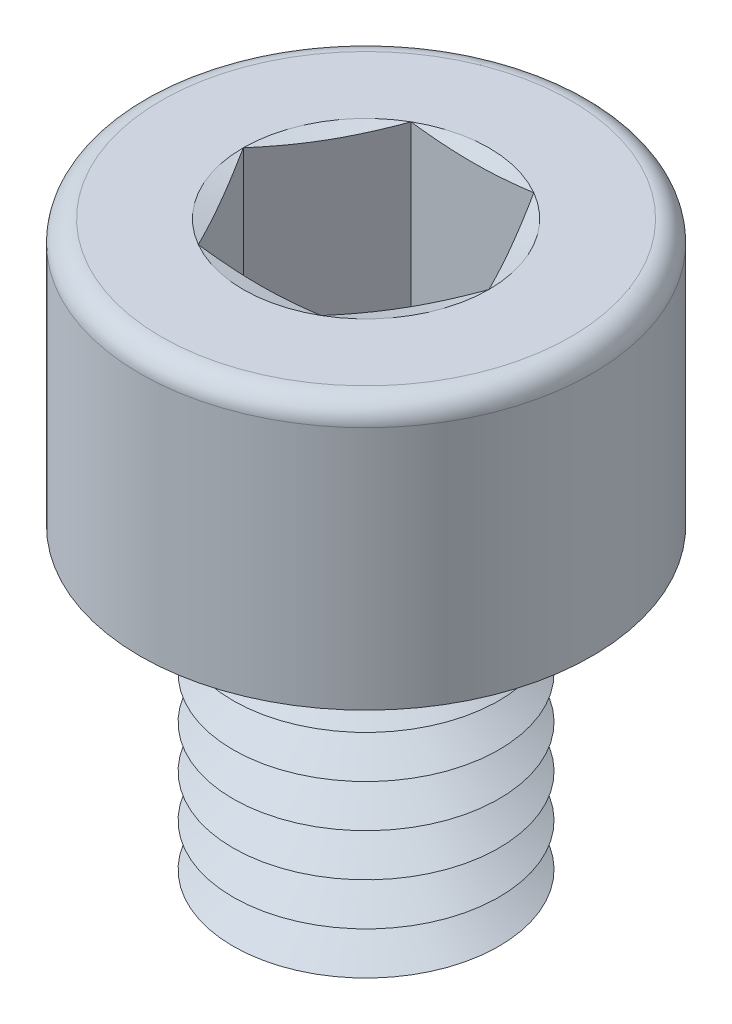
ISO-10303-21;
HEADER;
FILE_DESCRIPTION(('STEP AP214'),'2;1');
FILE_NAME('part.step','',(''),(''),'','','');
FILE_SCHEMA(('AUTOMOTIVE_DESIGN { 1 0 10303 214 1 1 1 1 }'));
ENDSEC;
DATA;
#1=APPLICATION_CONTEXT('core data for automotive mechanical design processes');
#2=APPLICATION_PROTOCOL_DEFINITION('international standard','automotive_design',2000,#1);
#3=PRODUCT_CONTEXT('',#1,'mechanical');
#4=PRODUCT('Part','Part','',(#3));
#5=PRODUCT_RELATED_PRODUCT_CATEGORY('part','',(#4));
#6=PRODUCT_DEFINITION_FORMATION('','',#4);
#7=PRODUCT_DEFINITION_CONTEXT('part definition',#1,'design');
#8=PRODUCT_DEFINITION('design','',#6,#7);
#9=PRODUCT_DEFINITION_SHAPE('','',#8);
#10=(LENGTH_UNIT() NAMED_UNIT(*) SI_UNIT(.MILLI.,.METRE.));
#11=(NAMED_UNIT(*) PLANE_ANGLE_UNIT() SI_UNIT($,.RADIAN.));
#12=(NAMED_UNIT(*) SI_UNIT($,.STERADIAN.) SOLID_ANGLE_UNIT());
#13=UNCERTAINTY_MEASURE_WITH_UNIT(LENGTH_MEASURE(1.E-05),#10,'distance_accuracy_value','');
#14=(GEOMETRIC_REPRESENTATION_CONTEXT(3) GLOBAL_UNCERTAINTY_ASSIGNED_CONTEXT((#13)) GLOBAL_UNIT_ASSIGNED_CONTEXT((#10,
#11,#12)) REPRESENTATION_CONTEXT('',''));
#15=CARTESIAN_POINT('',(0.,0.,0.));
#16=DIRECTION('',(0.,0.,1.));
#17=DIRECTION('',(1.,0.,0.));
#18=AXIS2_PLACEMENT_3D('',#15,#16,#17);
#19=CARTESIAN_POINT('',(0.,3.2,0.));
#20=DIRECTION('',(0.,1.,0.));
#21=DIRECTION('',(0.,0.,1.));
#22=AXIS2_PLACEMENT_3D('',#19,#20,#21);
#23=CONICAL_SURFACE('',#22,1.80717967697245,1.0471975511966);
#24=CARTESIAN_POINT('',(0.,3.6,0.));
#25=DIRECTION('',(0.,1.,0.));
#26=DIRECTION('',(0.,0.,1.));
#27=AXIS2_PLACEMENT_3D('',#24,#25,#26);
#28=CIRCLE('',#27,2.5);
#29=CARTESIAN_POINT('',(0.,3.6,2.5));
#30=VERTEX_POINT('',#29);
#31=EDGE_CURVE('E369',#30,#30,#28,.T.);
#32=ORIENTED_EDGE('',*,*,#31,.F.);
#33=EDGE_LOOP('',(#32));
#34=FACE_BOUND('',#33,.T.);
#35=CARTESIAN_POINT('',(0.,3.2,0.));
#36=DIRECTION('',(0.,1.,0.));
#37=DIRECTION('',(0.,0.,1.));
#38=AXIS2_PLACEMENT_3D('',#35,#36,#37);
#39=CIRCLE('',#38,1.80717967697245);
#40=CARTESIAN_POINT('',(0.,3.2,1.80717967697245));
#41=VERTEX_POINT('',#40);
#42=EDGE_CURVE('E373',#41,#41,#39,.T.);
#43=ORIENTED_EDGE('',*,*,#42,.T.);
#44=EDGE_LOOP('',(#43));
#45=FACE_BOUND('',#44,.T.);
#46=ADVANCED_FACE('F41',(#34,#45),#23,.T.);
#47=CARTESIAN_POINT('',(0.,2.8,0.));
#48=DIRECTION('',(0.,-1.,0.));
#49=DIRECTION('',(0.,0.,-1.));
#50=AXIS2_PLACEMENT_3D('',#47,#48,#49);
#51=CONICAL_SURFACE('',#50,2.5,1.0471975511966);
#52=ORIENTED_EDGE('',*,*,#42,.F.);
#53=EDGE_LOOP('',(#52));
#54=FACE_BOUND('',#53,.T.);
#55=CARTESIAN_POINT('',(0.,2.8,0.));
#56=DIRECTION('',(0.,1.,0.));
#57=DIRECTION('',(0.,0.,1.));
#58=AXIS2_PLACEMENT_3D('',#55,#56,#57);
#59=CIRCLE('',#58,2.5);
#60=CARTESIAN_POINT('',(0.,2.8,2.5));
#61=VERTEX_POINT('',#60);
#62=EDGE_CURVE('E377',#61,#61,#59,.T.);
#63=ORIENTED_EDGE('',*,*,#62,.T.);
#64=EDGE_LOOP('',(#63));
#65=FACE_BOUND('',#64,.T.);
#66=ADVANCED_FACE('F249',(#54,#65),#51,.T.);
#67=CARTESIAN_POINT('',(0.,0.,0.));
#68=DIRECTION('',(0.,1.,0.));
#69=DIRECTION('',(0.,0.,1.));
#70=AXIS2_PLACEMENT_3D('',#67,#68,#69);
#71=PLANE('',#70);
#72=CARTESIAN_POINT('',(0.,0.,0.));
#73=DIRECTION('',(0.,1.,0.));
#74=DIRECTION('',(0.,0.,1.));
#75=AXIS2_PLACEMENT_3D('',#72,#73,#74);
#76=CIRCLE('',#75,1.80717967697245);
#77=CARTESIAN_POINT('',(0.,0.,1.80717967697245));
#78=VERTEX_POINT('',#77);
#79=EDGE_CURVE('E404',#78,#78,#76,.T.);
#80=ORIENTED_EDGE('',*,*,#79,.F.);
#81=EDGE_LOOP('',(#80));
#82=FACE_BOUND('',#81,.T.);
#83=ADVANCED_FACE('F246',(#82),#71,.F.);
#84=CARTESIAN_POINT('',(0.,0.,0.));
#85=DIRECTION('',(0.,1.,0.));
#86=DIRECTION('',(0.,0.,1.));
#87=AXIS2_PLACEMENT_3D('',#84,#85,#86);
#88=CONICAL_SURFACE('',#87,1.80717967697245,1.0471975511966);
#89=CARTESIAN_POINT('',(0.,0.4,0.));
#90=DIRECTION('',(0.,1.,0.));
#91=DIRECTION('',(0.,0.,1.));
#92=AXIS2_PLACEMENT_3D('',#89,#90,#91);
#93=CIRCLE('',#92,2.5);
#94=CARTESIAN_POINT('',(0.,0.4,2.5));
#95=VERTEX_POINT('',#94);
#96=EDGE_CURVE('E400',#95,#95,#93,.T.);
#97=ORIENTED_EDGE('',*,*,#96,.F.);
#98=EDGE_LOOP('',(#97));
#99=FACE_BOUND('',#98,.T.);
#100=ORIENTED_EDGE('',*,*,#79,.T.);
#101=EDGE_LOOP('',(#100));
#102=FACE_BOUND('',#101,.T.);
#103=ADVANCED_FACE('F248',(#99,#102),#88,.T.);
#104=CARTESIAN_POINT('',(0.,0.4,0.));
#105=DIRECTION('',(0.,-1.,0.));
#106=DIRECTION('',(0.,0.,-1.));
#107=AXIS2_PLACEMENT_3D('',#104,#105,#106);
#108=CONICAL_SURFACE('',#107,2.5,1.0471975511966);
#109=CARTESIAN_POINT('',(0.,0.8,0.));
#110=DIRECTION('',(0.,1.,0.));
#111=DIRECTION('',(0.,0.,1.));
#112=AXIS2_PLACEMENT_3D('',#109,#110,#111);
#113=CIRCLE('',#112,1.80717967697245);
#114=CARTESIAN_POINT('',(0.,0.8,1.80717967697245));
#115=VERTEX_POINT('',#114);
#116=EDGE_CURVE('E396',#115,#115,#113,.T.);
#117=ORIENTED_EDGE('',*,*,#116,.F.);
#118=EDGE_LOOP('',(#117));
#119=FACE_BOUND('',#118,.T.);
#120=ORIENTED_EDGE('',*,*,#96,.T.);
#121=EDGE_LOOP('',(#120));
#122=FACE_BOUND('',#121,.T.);
#123=ADVANCED_FACE('F255',(#119,#122),#108,.T.);
#124=CARTESIAN_POINT('',(0.,0.8,0.));
#125=DIRECTION('',(0.,1.,0.));
#126=DIRECTION('',(0.,0.,1.));
#127=AXIS2_PLACEMENT_3D('',#124,#125,#126);
#128=CONICAL_SURFACE('',#127,1.80717967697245,1.0471975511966);
#129=CARTESIAN_POINT('',(0.,1.2,0.));
#130=DIRECTION('',(0.,1.,0.));
#131=DIRECTION('',(0.,0.,1.));
#132=AXIS2_PLACEMENT_3D('',#129,#130,#131);
#133=CIRCLE('',#132,2.5);
#134=CARTESIAN_POINT('',(0.,1.2,2.5));
#135=VERTEX_POINT('',#134);
#136=EDGE_CURVE('E393',#135,#135,#133,.T.);
#137=ORIENTED_EDGE('',*,*,#136,.F.);
#138=EDGE_LOOP('',(#137));
#139=FACE_BOUND('',#138,.T.);
#140=ORIENTED_EDGE('',*,*,#116,.T.);
#141=EDGE_LOOP('',(#140));
#142=FACE_BOUND('',#141,.T.);
#143=ADVANCED_FACE('F283',(#139,#142),#128,.T.);
#144=CARTESIAN_POINT('',(0.,1.2,0.));
#145=DIRECTION('',(0.,-1.,0.));
#146=DIRECTION('',(0.,0.,-1.));
#147=AXIS2_PLACEMENT_3D('',#144,#145,#146);
#148=CONICAL_SURFACE('',#147,2.5,1.0471975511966);
#149=CARTESIAN_POINT('',(0.,1.6,0.));
#150=DIRECTION('',(0.,1.,0.));
#151=DIRECTION('',(0.,0.,1.));
#152=AXIS2_PLACEMENT_3D('',#149,#150,#151);
#153=CIRCLE('',#152,1.80717967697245);
#154=CARTESIAN_POINT('',(0.,1.6,1.80717967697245));
#155=VERTEX_POINT('',#154);
#156=EDGE_CURVE('E389',#155,#155,#153,.T.);
#157=ORIENTED_EDGE('',*,*,#156,.F.);
#158=EDGE_LOOP('',(#157));
#159=FACE_BOUND('',#158,.T.);
#160=ORIENTED_EDGE('',*,*,#136,.T.);
#161=EDGE_LOOP('',(#160));
#162=FACE_BOUND('',#161,.T.);
#163=ADVANCED_FACE('F280',(#159,#162),#148,.T.);
#164=CARTESIAN_POINT('',(0.,1.6,0.));
#165=DIRECTION('',(0.,1.,0.));
#166=DIRECTION('',(0.,0.,1.));
#167=AXIS2_PLACEMENT_3D('',#164,#165,#166);
#168=CONICAL_SURFACE('',#167,1.80717967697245,1.0471975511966);
#169=CARTESIAN_POINT('',(0.,2.,0.));
#170=DIRECTION('',(0.,1.,0.));
#171=DIRECTION('',(0.,0.,1.));
#172=AXIS2_PLACEMENT_3D('',#169,#170,#171);
#173=CIRCLE('',#172,2.5);
#174=CARTESIAN_POINT('',(0.,2.,2.5));
#175=VERTEX_POINT('',#174);
#176=EDGE_CURVE('E385',#175,#175,#173,.T.);
#177=ORIENTED_EDGE('',*,*,#176,.F.);
#178=EDGE_LOOP('',(#177));
#179=FACE_BOUND('',#178,.T.);
#180=ORIENTED_EDGE('',*,*,#156,.T.);
#181=EDGE_LOOP('',(#180));
#182=FACE_BOUND('',#181,.T.);
#183=ADVANCED_FACE('F274',(#179,#182),#168,.T.);
#184=CARTESIAN_POINT('',(0.,2.,0.));
#185=DIRECTION('',(0.,-1.,0.));
#186=DIRECTION('',(0.,0.,-1.));
#187=AXIS2_PLACEMENT_3D('',#184,#185,#186);
#188=CONICAL_SURFACE('',#187,2.5,1.0471975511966);
#189=CARTESIAN_POINT('',(0.,2.4,0.));
#190=DIRECTION('',(0.,1.,0.));
#191=DIRECTION('',(0.,0.,1.));
#192=AXIS2_PLACEMENT_3D('',#189,#190,#191);
#193=CIRCLE('',#192,1.80717967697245);
#194=CARTESIAN_POINT('',(0.,2.4,1.80717967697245));
#195=VERTEX_POINT('',#194);
#196=EDGE_CURVE('E381',#195,#195,#193,.T.);
#197=ORIENTED_EDGE('',*,*,#196,.F.);
#198=EDGE_LOOP('',(#197));
#199=FACE_BOUND('',#198,.T.);
#200=ORIENTED_EDGE('',*,*,#176,.T.);
#201=EDGE_LOOP('',(#200));
#202=FACE_BOUND('',#201,.T.);
#203=ADVANCED_FACE('F270',(#199,#202),#188,.T.);
#204=CARTESIAN_POINT('',(0.,2.4,0.));
#205=DIRECTION('',(0.,1.,0.));
#206=DIRECTION('',(0.,0.,1.));
#207=AXIS2_PLACEMENT_3D('',#204,#205,#206);
#208=CONICAL_SURFACE('',#207,1.80717967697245,1.0471975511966);
#209=ORIENTED_EDGE('',*,*,#62,.F.);
#210=EDGE_LOOP('',(#209));
#211=FACE_BOUND('',#210,.T.);
#212=ORIENTED_EDGE('',*,*,#196,.T.);
#213=EDGE_LOOP('',(#212));
#214=FACE_BOUND('',#213,.T.);
#215=ADVANCED_FACE('F273',(#211,#214),#208,.T.);
#216=CARTESIAN_POINT('',(0.,4.,0.));
#217=DIRECTION('',(0.,1.,0.));
#218=DIRECTION('',(0.,0.,1.));
#219=AXIS2_PLACEMENT_3D('',#216,#217,#218);
#220=CONICAL_SURFACE('',#219,1.80717967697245,1.0471975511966);
#221=CARTESIAN_POINT('',(0.,4.4,0.));
#222=DIRECTION('',(0.,1.,0.));
#223=DIRECTION('',(0.,0.,1.));
#224=AXIS2_PLACEMENT_3D('',#221,#222,#223);
#225=CIRCLE('',#224,2.5);
#226=CARTESIAN_POINT('',(0.,4.4,2.5));
#227=VERTEX_POINT('',#226);
#228=EDGE_CURVE('E361',#227,#227,#225,.T.);
#229=ORIENTED_EDGE('',*,*,#228,.F.);
#230=EDGE_LOOP('',(#229));
#231=FACE_BOUND('',#230,.T.);
#232=CARTESIAN_POINT('',(0.,4.,0.));
#233=DIRECTION('',(0.,1.,0.));
#234=DIRECTION('',(0.,0.,1.));
#235=AXIS2_PLACEMENT_3D('',#232,#233,#234);
#236=CIRCLE('',#235,1.80717967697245);
#237=CARTESIAN_POINT('',(0.,4.,1.80717967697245));
#238=VERTEX_POINT('',#237);
#239=EDGE_CURVE('E365',#238,#238,#236,.T.);
#240=ORIENTED_EDGE('',*,*,#239,.T.);
#241=EDGE_LOOP('',(#240));
#242=FACE_BOUND('',#241,.T.);
#243=ADVANCED_FACE('F278',(#231,#242),#220,.T.);
#244=CARTESIAN_POINT('',(0.,3.6,0.));
#245=DIRECTION('',(0.,-1.,0.));
#246=DIRECTION('',(0.,0.,-1.));
#247=AXIS2_PLACEMENT_3D('',#244,#245,#246);
#248=CONICAL_SURFACE('',#247,2.5,1.0471975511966);
#249=ORIENTED_EDGE('',*,*,#239,.F.);
#250=EDGE_LOOP('',(#249));
#251=FACE_BOUND('',#250,.T.);
#252=ORIENTED_EDGE('',*,*,#31,.T.);
#253=EDGE_LOOP('',(#252));
#254=FACE_BOUND('',#253,.T.);
#255=ADVANCED_FACE('F663',(#251,#254),#248,.T.);
#256=CARTESIAN_POINT('',(0.,4.8,0.));
#257=DIRECTION('',(0.,1.,0.));
#258=DIRECTION('',(0.,0.,1.));
#259=AXIS2_PLACEMENT_3D('',#256,#257,#258);
#260=CONICAL_SURFACE('',#259,1.80717967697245,1.0471975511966);
#261=CARTESIAN_POINT('',(0.,5.2,0.));
#262=DIRECTION('',(0.,1.,0.));
#263=DIRECTION('',(0.,0.,1.));
#264=AXIS2_PLACEMENT_3D('',#261,#262,#263);
#265=CIRCLE('',#264,2.5);
#266=CARTESIAN_POINT('',(0.,5.2,2.5));
#267=VERTEX_POINT('',#266);
#268=EDGE_CURVE('E345',#267,#267,#265,.T.);
#269=ORIENTED_EDGE('',*,*,#268,.F.);
#270=EDGE_LOOP('',(#269));
#271=FACE_BOUND('',#270,.T.);
#272=CARTESIAN_POINT('',(0.,4.8,0.));
#273=DIRECTION('',(0.,1.,0.));
#274=DIRECTION('',(0.,0.,1.));
#275=AXIS2_PLACEMENT_3D('',#272,#273,#274);
#276=CIRCLE('',#275,1.80717967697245);
#277=CARTESIAN_POINT('',(0.,4.8,1.80717967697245));
#278=VERTEX_POINT('',#277);
#279=EDGE_CURVE('E358',#278,#278,#276,.T.);
#280=ORIENTED_EDGE('',*,*,#279,.T.);
#281=EDGE_LOOP('',(#280));
#282=FACE_BOUND('',#281,.T.);
#283=ADVANCED_FACE('F672',(#271,#282),#260,.T.);
#284=CARTESIAN_POINT('',(0.,4.4,0.));
#285=DIRECTION('',(0.,-1.,0.));
#286=DIRECTION('',(0.,0.,-1.));
#287=AXIS2_PLACEMENT_3D('',#284,#285,#286);
#288=CONICAL_SURFACE('',#287,2.5,1.0471975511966);
#289=ORIENTED_EDGE('',*,*,#279,.F.);
#290=EDGE_LOOP('',(#289));
#291=FACE_BOUND('',#290,.T.);
#292=ORIENTED_EDGE('',*,*,#228,.T.);
#293=EDGE_LOOP('',(#292));
#294=FACE_BOUND('',#293,.T.);
#295=ADVANCED_FACE('F682',(#291,#294),#288,.T.);
#296=CARTESIAN_POINT('',(0.,5.6,0.));
#297=DIRECTION('',(0.,1.,0.));
#298=DIRECTION('',(0.,0.,1.));
#299=AXIS2_PLACEMENT_3D('',#296,#297,#298);
#300=CONICAL_SURFACE('',#299,1.80717967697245,1.0471975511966);
#301=CARTESIAN_POINT('',(0.,6.,0.));
#302=DIRECTION('',(0.,1.,0.));
#303=DIRECTION('',(0.,0.,1.));
#304=AXIS2_PLACEMENT_3D('',#301,#302,#303);
#305=CIRCLE('',#304,2.5);
#306=CARTESIAN_POINT('',(0.,6.,2.5));
#307=VERTEX_POINT('',#306);
#308=EDGE_CURVE('E352',#307,#307,#305,.T.);
#309=ORIENTED_EDGE('',*,*,#308,.F.);
#310=EDGE_LOOP('',(#309));
#311=FACE_BOUND('',#310,.T.);
#312=CARTESIAN_POINT('',(0.,5.6,0.));
#313=DIRECTION('',(0.,1.,0.));
#314=DIRECTION('',(0.,0.,1.));
#315=AXIS2_PLACEMENT_3D('',#312,#313,#314);
#316=CIRCLE('',#315,1.80717967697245);
#317=CARTESIAN_POINT('',(0.,5.6,1.80717967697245));
#318=VERTEX_POINT('',#317);
#319=EDGE_CURVE('E341',#318,#318,#316,.T.);
#320=ORIENTED_EDGE('',*,*,#319,.T.);
#321=EDGE_LOOP('',(#320));
#322=FACE_BOUND('',#321,.T.);
#323=ADVANCED_FACE('F692',(#311,#322),#300,.T.);
#324=CARTESIAN_POINT('',(0.,5.2,0.));
#325=DIRECTION('',(0.,-1.,0.));
#326=DIRECTION('',(0.,0.,-1.));
#327=AXIS2_PLACEMENT_3D('',#324,#325,#326);
#328=CONICAL_SURFACE('',#327,2.5,1.0471975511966);
#329=ORIENTED_EDGE('',*,*,#319,.F.);
#330=EDGE_LOOP('',(#329));
#331=FACE_BOUND('',#330,.T.);
#332=ORIENTED_EDGE('',*,*,#268,.T.);
#333=EDGE_LOOP('',(#332));
#334=FACE_BOUND('',#333,.T.);
#335=ADVANCED_FACE('F195',(#331,#334),#328,.T.);
#336=CARTESIAN_POINT('',(0.,11.,0.));
#337=DIRECTION('',(0.,1.,0.));
#338=DIRECTION('',(0.,0.,1.));
#339=AXIS2_PLACEMENT_3D('',#336,#337,#338);
#340=PLANE('',#339);
#341=CARTESIAN_POINT('',(0.,11.,0.));
#342=DIRECTION('',(0.,1.,0.));
#343=DIRECTION('',(0.,0.,1.));
#344=AXIS2_PLACEMENT_3D('',#341,#342,#343);
#345=CIRCLE('',#344,2.3094010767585);
#346=CARTESIAN_POINT('',(1.15470053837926,11.,2.));
#347=VERTEX_POINT('',#346);
#348=CARTESIAN_POINT('',(2.3094010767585,11.,0.));
#349=VERTEX_POINT('',#348);
#350=EDGE_CURVE('E121',#347,#349,#345,.T.);
#351=ORIENTED_EDGE('',*,*,#350,.F.);
#352=CARTESIAN_POINT('',(0.,11.,0.));
#353=DIRECTION('',(0.,1.,0.));
#354=DIRECTION('',(0.,0.,1.));
#355=AXIS2_PLACEMENT_3D('',#352,#353,#354);
#356=CIRCLE('',#355,2.3094010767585);
#357=CARTESIAN_POINT('',(-1.15470053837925,11.,2.));
#358=VERTEX_POINT('',#357);
#359=EDGE_CURVE('E45',#358,#347,#356,.T.);
#360=ORIENTED_EDGE('',*,*,#359,.F.);
#361=CARTESIAN_POINT('',(-2.3094010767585,11.,0.));
#362=VERTEX_POINT('',#361);
#363=EDGE_CURVE('E138',#362,#358,#356,.T.);
#364=ORIENTED_EDGE('',*,*,#363,.F.);
#365=CARTESIAN_POINT('',(-1.15470053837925,11.,-2.));
#366=VERTEX_POINT('',#365);
#367=EDGE_CURVE('E477',#366,#362,#356,.T.);
#368=ORIENTED_EDGE('',*,*,#367,.F.);
#369=CARTESIAN_POINT('',(1.15470053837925,11.,-2.));
#370=VERTEX_POINT('',#369);
#371=EDGE_CURVE('E51',#370,#366,#356,.T.);
#372=ORIENTED_EDGE('',*,*,#371,.F.);
#373=EDGE_CURVE('E11',#349,#370,#356,.T.);
#374=ORIENTED_EDGE('',*,*,#373,.F.);
#375=EDGE_LOOP('',(#351,#360,#364,#368,#372,#374));
#376=FACE_BOUND('',#375,.T.);
#377=CARTESIAN_POINT('',(0.,11.,0.));
#378=DIRECTION('',(0.,1.,0.));
#379=DIRECTION('',(0.,0.,1.));
#380=AXIS2_PLACEMENT_3D('',#377,#378,#379);
#381=CIRCLE('',#380,3.85);
#382=CARTESIAN_POINT('',(0.,11.,3.85));
#383=VERTEX_POINT('',#382);
#384=EDGE_CURVE('E444',#383,#383,#381,.T.);
#385=ORIENTED_EDGE('',*,*,#384,.T.);
#386=EDGE_LOOP('',(#385));
#387=FACE_BOUND('',#386,.T.);
#388=ADVANCED_FACE('F140',(#376,#387),#340,.T.);
#389=CARTESIAN_POINT('',(0.,10.6,0.));
#390=DIRECTION('',(0.,1.,0.));
#391=DIRECTION('',(0.,0.,1.));
#392=AXIS2_PLACEMENT_3D('',#389,#390,#391);
#393=TOROIDAL_SURFACE('',#392,3.85,0.4);
#394=CARTESIAN_POINT('',(0.,10.6,0.));
#395=DIRECTION('',(0.,1.,0.));
#396=DIRECTION('',(0.,0.,1.));
#397=AXIS2_PLACEMENT_3D('',#394,#395,#396);
#398=CIRCLE('',#397,4.25);
#399=CARTESIAN_POINT('',(0.,10.6,4.25));
#400=VERTEX_POINT('',#399);
#401=EDGE_CURVE('E448',#400,#400,#398,.F.);
#402=ORIENTED_EDGE('',*,*,#401,.F.);
#403=EDGE_LOOP('',(#402));
#404=FACE_BOUND('',#403,.T.);
#405=ORIENTED_EDGE('',*,*,#384,.F.);
#406=EDGE_LOOP('',(#405));
#407=FACE_BOUND('',#406,.T.);
#408=ADVANCED_FACE('F43',(#404,#407),#393,.T.);
#409=CARTESIAN_POINT('',(0.,11.,0.));
#410=DIRECTION('',(0.,-1.,0.));
#411=DIRECTION('',(0.,0.,-1.));
#412=AXIS2_PLACEMENT_3D('',#409,#410,#411);
#413=CYLINDRICAL_SURFACE('',#412,4.25);
#414=ORIENTED_EDGE('',*,*,#401,.T.);
#415=EDGE_LOOP('',(#414));
#416=FACE_BOUND('',#415,.T.);
#417=CARTESIAN_POINT('',(0.,6.,0.));
#418=DIRECTION('',(0.,1.,0.));
#419=DIRECTION('',(0.,0.,1.));
#420=AXIS2_PLACEMENT_3D('',#417,#418,#419);
#421=CIRCLE('',#420,4.25);
#422=CARTESIAN_POINT('',(0.,6.,4.25));
#423=VERTEX_POINT('',#422);
#424=EDGE_CURVE('E435',#423,#423,#421,.T.);
#425=ORIENTED_EDGE('',*,*,#424,.T.);
#426=EDGE_LOOP('',(#425));
#427=FACE_BOUND('',#426,.T.);
#428=ADVANCED_FACE('F242',(#416,#427),#413,.T.);
#429=CARTESIAN_POINT('',(0.,6.,0.));
#430=DIRECTION('',(0.,1.,0.));
#431=DIRECTION('',(0.,0.,1.));
#432=AXIS2_PLACEMENT_3D('',#429,#430,#431);
#433=PLANE('',#432);
#434=ORIENTED_EDGE('',*,*,#424,.F.);
#435=EDGE_LOOP('',(#434));
#436=FACE_BOUND('',#435,.T.);
#437=ORIENTED_EDGE('',*,*,#308,.T.);
#438=EDGE_LOOP('',(#437));
#439=FACE_BOUND('',#438,.T.);
#440=ADVANCED_FACE('F239',(#436,#439),#433,.F.);
#441=CARTESIAN_POINT('',(0.,11.,0.));
#442=DIRECTION('',(0.,1.,0.));
#443=DIRECTION('',(0.,0.,1.));
#444=AXIS2_PLACEMENT_3D('',#441,#442,#443);
#445=CONICAL_SURFACE('',#444,2.3094010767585,1.30899693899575);
#446=ORIENTED_EDGE('',*,*,#359,.T.);
#447=CARTESIAN_POINT('',(-3.01440758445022,11.3505168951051,2.));
#448=CARTESIAN_POINT('',(-2.92409762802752,11.3303563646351,2.));
#449=CARTESIAN_POINT('',(-2.83373054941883,11.3104525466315,2.));
#450=CARTESIAN_POINT('',(-2.65285291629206,11.2712885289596,2.));
#451=CARTESIAN_POINT('',(-2.562342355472,11.2520283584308,2.));
#452=CARTESIAN_POINT('',(-2.29037985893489,11.1953730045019,2.));
#453=CARTESIAN_POINT('',(-2.10868043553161,11.159144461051,2.));
#454=CARTESIAN_POINT('',(-1.74597297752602,11.0917168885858,2.));
#455=CARTESIAN_POINT('',(-1.56497266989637,11.060476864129,2.));
#456=CARTESIAN_POINT('',(-1.20186568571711,11.0051382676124,2.));
#457=CARTESIAN_POINT('',(-1.01975924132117,10.9810382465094,2.));
#458=CARTESIAN_POINT('',(-0.744747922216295,10.9525901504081,2.));
#459=CARTESIAN_POINT('',(-0.652245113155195,10.9443671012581,2.));
#460=CARTESIAN_POINT('',(-0.46702062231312,10.9309940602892,2.));
#461=CARTESIAN_POINT('',(-0.374298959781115,10.925843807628,2.));
#462=CARTESIAN_POINT('',(-0.188764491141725,10.9189154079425,2.));
#463=CARTESIAN_POINT('',(-0.0959517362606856,10.9171359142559,2.));
#464=CARTESIAN_POINT('',(0.0896753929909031,10.9170578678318,2.));
#465=CARTESIAN_POINT('',(0.182489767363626,10.918759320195,2.));
#466=CARTESIAN_POINT('',(0.368369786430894,10.9255489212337,2.));
#467=CARTESIAN_POINT('',(0.461434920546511,10.9306507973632,2.));
#468=CARTESIAN_POINT('',(0.647346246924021,10.943956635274,2.));
#469=CARTESIAN_POINT('',(0.740192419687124,10.9521608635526,2.));
#470=CARTESIAN_POINT('',(1.01841374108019,10.9808177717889,2.));
#471=CARTESIAN_POINT('',(1.2033713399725,11.0053101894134,2.));
#472=CARTESIAN_POINT('',(1.57694396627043,11.0623620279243,2.));
#473=CARTESIAN_POINT('',(1.76552771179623,11.0951161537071,2.));
#474=CARTESIAN_POINT('',(2.14178491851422,11.1655706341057,2.));
#475=CARTESIAN_POINT('',(2.32945822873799,11.2032717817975,2.));
#476=CARTESIAN_POINT('',(2.70417911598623,11.2818831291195,2.));
#477=CARTESIAN_POINT('',(2.89122649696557,11.3227942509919,2.));
#478=CARTESIAN_POINT('',(3.26484478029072,11.4067429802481,2.));
#479=CARTESIAN_POINT('',(3.45141567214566,11.4497806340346,2.));
#480=CARTESIAN_POINT('',(3.821938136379,11.5367817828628,2.));
#481=CARTESIAN_POINT('',(4.00589388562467,11.5807275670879,2.));
#482=CARTESIAN_POINT('',(4.37356350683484,11.6696352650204,2.));
#483=CARTESIAN_POINT('',(4.55727737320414,11.7145972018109,2.));
#484=CARTESIAN_POINT('',(4.92426602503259,11.8051983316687,2.));
#485=CARTESIAN_POINT('',(5.10754106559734,11.8508364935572,2.));
#486=CARTESIAN_POINT('',(5.47394280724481,11.9426769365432,2.));
#487=CARTESIAN_POINT('',(5.65706951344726,11.9888791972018,2.));
#488=CARTESIAN_POINT('',(5.84014583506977,12.0352780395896,2.));
#489=B_SPLINE_CURVE_WITH_KNOTS('',3,(#447,#448,#449,#450,#451,#452,#453,#454,#455,#456,#457,
#458,#459,#460,#461,#462,#463,#464,#465,#466,#467,#468,#469,#470,#471,#472,#473,#474,#475,#476,
#477,#478,#479,#480,#481,#482,#483,#484,#485,#486,#487,#488),.UNSPECIFIED.,.F.,.F.,(4,2,2,2,2,2,
2,2,2,2,2,2,2,2,2,2,2,2,2,2,4),(0.,0.277597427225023,0.555207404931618,1.11099118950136,
1.66194208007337,2.21278108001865,2.49134108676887,2.76987744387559,3.04830249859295,
3.32672796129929,3.60628428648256,3.88586463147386,4.44532615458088,5.01945893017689,
5.59368385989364,6.16807437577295,6.74247743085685,7.30986991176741,7.87727529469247,
8.44388991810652,9.01048407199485),.UNSPECIFIED.);
#490=EDGE_CURVE('E127',#358,#347,#489,.T.);
#491=ORIENTED_EDGE('',*,*,#490,.F.);
#492=EDGE_LOOP('',(#446,#491));
#493=FACE_BOUND('',#492,.T.);
#494=ADVANCED_FACE('F132',(#493),#445,.F.);
#495=ORIENTED_EDGE('',*,*,#363,.T.);
#496=CARTESIAN_POINT('',(-2.30951654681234,11.0000309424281,-0.000200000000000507));
#497=CARTESIAN_POINT('',(-2.26155517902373,10.9871729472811,0.0828715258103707));
#498=CARTESIAN_POINT('',(-2.21350683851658,10.9754999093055,0.166093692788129));
#499=CARTESIAN_POINT('',(-2.11724043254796,10.9549913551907,0.332831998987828));
#500=CARTESIAN_POINT('',(-2.0690223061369,10.9461569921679,0.416348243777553));
#501=CARTESIAN_POINT('',(-1.972708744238,10.931841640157,0.583168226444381));
#502=CARTESIAN_POINT('',(-1.92461396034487,10.9263435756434,0.666470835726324));
#503=CARTESIAN_POINT('',(-1.82836304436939,10.9189712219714,0.833182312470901));
#504=CARTESIAN_POINT('',(-1.78020692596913,10.9170962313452,0.91659115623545));
#505=CARTESIAN_POINT('',(-1.68389468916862,10.9170962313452,1.08340884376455));
#506=CARTESIAN_POINT('',(-1.63573857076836,10.9189712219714,1.1668176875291));
#507=CARTESIAN_POINT('',(-1.53948765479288,10.9263435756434,1.33352916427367));
#508=CARTESIAN_POINT('',(-1.49139287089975,10.931841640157,1.41683177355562));
#509=CARTESIAN_POINT('',(-1.39507930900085,10.9461569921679,1.58365175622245));
#510=CARTESIAN_POINT('',(-1.3468611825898,10.9549913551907,1.66716800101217));
#511=CARTESIAN_POINT('',(-1.25059477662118,10.9754999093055,1.83390630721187));
#512=CARTESIAN_POINT('',(-1.20254643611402,10.9871729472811,1.91712847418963));
#513=CARTESIAN_POINT('',(-1.15458506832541,11.0000309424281,2.0002));
#514=B_SPLINE_CURVE_WITH_KNOTS('',3,(#496,#497,#498,#499,#500,#501,#502,#503,#504,#505,#506,
#507,#508,#509,#510,#511,#512,#513),.UNSPECIFIED.,.F.,.F.,(4,2,2,2,2,2,2,2,4),(0.,
0.290357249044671,0.580832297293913,0.86980784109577,1.15872743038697,1.44764701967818,
1.73662256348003,2.02709761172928,2.31745486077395),.UNSPECIFIED.);
#515=EDGE_CURVE('E163',#362,#358,#514,.T.);
#516=ORIENTED_EDGE('',*,*,#515,.F.);
#517=EDGE_LOOP('',(#495,#516));
#518=FACE_BOUND('',#517,.T.);
#519=ADVANCED_FACE('F481',(#518),#445,.F.);
#520=ORIENTED_EDGE('',*,*,#367,.T.);
#521=CARTESIAN_POINT('',(-1.15458506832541,11.0000309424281,-2.0002));
#522=CARTESIAN_POINT('',(-1.20254643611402,10.9871729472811,-1.91712847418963));
#523=CARTESIAN_POINT('',(-1.25059477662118,10.9754999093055,-1.83390630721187));
#524=CARTESIAN_POINT('',(-1.3468611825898,10.9549913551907,-1.66716800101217));
#525=CARTESIAN_POINT('',(-1.39507930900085,10.9461569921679,-1.58365175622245));
#526=CARTESIAN_POINT('',(-1.49139287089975,10.931841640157,-1.41683177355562));
#527=CARTESIAN_POINT('',(-1.53948765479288,10.9263435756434,-1.33352916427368));
#528=CARTESIAN_POINT('',(-1.63573857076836,10.9189712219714,-1.1668176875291));
#529=CARTESIAN_POINT('',(-1.68389468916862,10.9170962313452,-1.08340884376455));
#530=CARTESIAN_POINT('',(-1.78020692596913,10.9170962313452,-0.916591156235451));
#531=CARTESIAN_POINT('',(-1.82836304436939,10.9189712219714,-0.833182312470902));
#532=CARTESIAN_POINT('',(-1.92461396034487,10.9263435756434,-0.666470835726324));
#533=CARTESIAN_POINT('',(-1.972708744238,10.931841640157,-0.583168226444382));
#534=CARTESIAN_POINT('',(-2.0690223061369,10.9461569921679,-0.416348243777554));
#535=CARTESIAN_POINT('',(-2.11724043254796,10.9549913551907,-0.332831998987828));
#536=CARTESIAN_POINT('',(-2.21350683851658,10.9754999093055,-0.16609369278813));
#537=CARTESIAN_POINT('',(-2.26155517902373,10.9871729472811,-0.0828715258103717));
#538=CARTESIAN_POINT('',(-2.30951654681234,11.0000309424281,0.000199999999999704));
#539=B_SPLINE_CURVE_WITH_KNOTS('',3,(#521,#522,#523,#524,#525,#526,#527,#528,#529,#530,#531,
#532,#533,#534,#535,#536,#537,#538),.UNSPECIFIED.,.F.,.F.,(4,2,2,2,2,2,2,2,4),(0.,
0.29035724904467,0.580832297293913,0.869807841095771,1.15872743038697,1.44764701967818,
1.73662256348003,2.02709761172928,2.31745486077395),.UNSPECIFIED.);
#540=EDGE_CURVE('E63',#366,#362,#539,.T.);
#541=ORIENTED_EDGE('',*,*,#540,.F.);
#542=EDGE_LOOP('',(#520,#541));
#543=FACE_BOUND('',#542,.T.);
#544=ADVANCED_FACE('F193',(#543),#445,.F.);
#545=ORIENTED_EDGE('',*,*,#371,.T.);
#546=CARTESIAN_POINT('',(-3.01440758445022,11.3505168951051,-2.));
#547=CARTESIAN_POINT('',(-2.92409762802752,11.3303563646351,-2.));
#548=CARTESIAN_POINT('',(-2.83373054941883,11.3104525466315,-2.));
#549=CARTESIAN_POINT('',(-2.65285291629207,11.2712885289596,-2.));
#550=CARTESIAN_POINT('',(-2.562342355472,11.2520283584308,-2.));
#551=CARTESIAN_POINT('',(-2.29037985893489,11.1953730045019,-2.));
#552=CARTESIAN_POINT('',(-2.10868043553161,11.159144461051,-2.));
#553=CARTESIAN_POINT('',(-1.74597297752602,11.0917168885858,-2.));
#554=CARTESIAN_POINT('',(-1.56497266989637,11.060476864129,-2.));
#555=CARTESIAN_POINT('',(-1.20186568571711,11.0051382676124,-2.));
#556=CARTESIAN_POINT('',(-1.01975924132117,10.9810382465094,-2.));
#557=CARTESIAN_POINT('',(-0.744747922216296,10.9525901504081,-2.));
#558=CARTESIAN_POINT('',(-0.652245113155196,10.9443671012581,-2.));
#559=CARTESIAN_POINT('',(-0.467020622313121,10.9309940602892,-2.));
#560=CARTESIAN_POINT('',(-0.374298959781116,10.925843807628,-2.));
#561=CARTESIAN_POINT('',(-0.188764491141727,10.9189154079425,-2.));
#562=CARTESIAN_POINT('',(-0.0959517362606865,10.9171359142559,-2.));
#563=CARTESIAN_POINT('',(0.0896753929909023,10.9170578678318,-2.));
#564=CARTESIAN_POINT('',(0.182489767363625,10.918759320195,-2.));
#565=CARTESIAN_POINT('',(0.368369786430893,10.9255489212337,-2.));
#566=CARTESIAN_POINT('',(0.46143492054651,10.9306507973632,-2.));
#567=CARTESIAN_POINT('',(0.64734624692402,10.943956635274,-2.));
#568=CARTESIAN_POINT('',(0.740192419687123,10.9521608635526,-2.));
#569=CARTESIAN_POINT('',(1.01841374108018,10.9808177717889,-2.));
#570=CARTESIAN_POINT('',(1.2033713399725,11.0053101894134,-2.));
#571=CARTESIAN_POINT('',(1.57694396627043,11.0623620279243,-2.));
#572=CARTESIAN_POINT('',(1.76552771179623,11.0951161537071,-2.));
#573=CARTESIAN_POINT('',(2.14178491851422,11.1655706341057,-2.));
#574=CARTESIAN_POINT('',(2.32945822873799,11.2032717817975,-2.));
#575=CARTESIAN_POINT('',(2.70417911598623,11.2818831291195,-2.));
#576=CARTESIAN_POINT('',(2.89122649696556,11.3227942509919,-2.));
#577=CARTESIAN_POINT('',(3.26484478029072,11.4067429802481,-2.));
#578=CARTESIAN_POINT('',(3.45141567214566,11.4497806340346,-2.));
#579=CARTESIAN_POINT('',(3.821938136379,11.5367817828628,-2.));
#580=CARTESIAN_POINT('',(4.00589388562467,11.5807275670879,-2.));
#581=CARTESIAN_POINT('',(4.37356350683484,11.6696352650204,-2.));
#582=CARTESIAN_POINT('',(4.55727737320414,11.7145972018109,-2.));
#583=CARTESIAN_POINT('',(4.92426602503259,11.8051983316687,-2.));
#584=CARTESIAN_POINT('',(5.10754106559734,11.8508364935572,-2.));
#585=CARTESIAN_POINT('',(5.47394280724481,11.9426769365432,-2.));
#586=CARTESIAN_POINT('',(5.65706951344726,11.9888791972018,-2.));
#587=CARTESIAN_POINT('',(5.84014583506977,12.0352780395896,-2.));
#588=B_SPLINE_CURVE_WITH_KNOTS('',3,(#546,#547,#548,#549,#550,#551,#552,#553,#554,#555,#556,
#557,#558,#559,#560,#561,#562,#563,#564,#565,#566,#567,#568,#569,#570,#571,#572,#573,#574,#575,
#576,#577,#578,#579,#580,#581,#582,#583,#584,#585,#586,#587),.UNSPECIFIED.,.F.,.F.,(4,2,2,2,2,2,
2,2,2,2,2,2,2,2,2,2,2,2,2,2,4),(0.,0.277597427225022,0.555207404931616,1.11099118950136,
1.66194208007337,2.21278108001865,2.49134108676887,2.76987744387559,3.04830249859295,
3.32672796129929,3.60628428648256,3.88586463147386,4.44532615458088,5.01945893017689,
5.59368385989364,6.16807437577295,6.74247743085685,7.30986991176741,7.87727529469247,
8.44388991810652,9.01048407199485),.UNSPECIFIED.);
#589=EDGE_CURVE('E214',#370,#366,#588,.F.);
#590=ORIENTED_EDGE('',*,*,#589,.F.);
#591=EDGE_LOOP('',(#545,#590));
#592=FACE_BOUND('',#591,.T.);
#593=ADVANCED_FACE('F188',(#592),#445,.F.);
#594=ORIENTED_EDGE('',*,*,#373,.T.);
#595=CARTESIAN_POINT('',(2.30951654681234,11.0000309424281,0.000199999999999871));
#596=CARTESIAN_POINT('',(2.26155517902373,10.9871729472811,-0.0828715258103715));
#597=CARTESIAN_POINT('',(2.21350683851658,10.9754999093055,-0.16609369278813));
#598=CARTESIAN_POINT('',(2.11724043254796,10.9549913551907,-0.332831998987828));
#599=CARTESIAN_POINT('',(2.0690223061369,10.9461569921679,-0.416348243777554));
#600=CARTESIAN_POINT('',(1.972708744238,10.931841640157,-0.583168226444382));
#601=CARTESIAN_POINT('',(1.92461396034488,10.9263435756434,-0.666470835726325));
#602=CARTESIAN_POINT('',(1.82836304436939,10.9189712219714,-0.833182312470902));
#603=CARTESIAN_POINT('',(1.78020692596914,10.9170962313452,-0.916591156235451));
#604=CARTESIAN_POINT('',(1.68389468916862,10.9170962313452,-1.08340884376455));
#605=CARTESIAN_POINT('',(1.63573857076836,10.9189712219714,-1.1668176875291));
#606=CARTESIAN_POINT('',(1.53948765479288,10.9263435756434,-1.33352916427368));
#607=CARTESIAN_POINT('',(1.49139287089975,10.931841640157,-1.41683177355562));
#608=CARTESIAN_POINT('',(1.39507930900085,10.9461569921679,-1.58365175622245));
#609=CARTESIAN_POINT('',(1.3468611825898,10.9549913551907,-1.66716800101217));
#610=CARTESIAN_POINT('',(1.25059477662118,10.9754999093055,-1.83390630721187));
#611=CARTESIAN_POINT('',(1.20254643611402,10.9871729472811,-1.91712847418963));
#612=CARTESIAN_POINT('',(1.15458506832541,11.0000309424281,-2.0002));
#613=B_SPLINE_CURVE_WITH_KNOTS('',3,(#595,#596,#597,#598,#599,#600,#601,#602,#603,#604,#605,
#606,#607,#608,#609,#610,#611,#612),.UNSPECIFIED.,.F.,.F.,(4,2,2,2,2,2,2,2,4),(0.,
0.290357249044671,0.580832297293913,0.869807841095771,1.15872743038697,1.44764701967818,
1.73662256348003,2.02709761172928,2.31745486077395),.UNSPECIFIED.);
#614=EDGE_CURVE('E56',#349,#370,#613,.T.);
#615=ORIENTED_EDGE('',*,*,#614,.F.);
#616=EDGE_LOOP('',(#594,#615));
#617=FACE_BOUND('',#616,.T.);
#618=ADVANCED_FACE('F192',(#617),#445,.F.);
#619=ORIENTED_EDGE('',*,*,#350,.T.);
#620=CARTESIAN_POINT('',(1.15458506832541,11.0000309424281,2.0002));
#621=CARTESIAN_POINT('',(1.20254643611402,10.9871729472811,1.91712847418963));
#622=CARTESIAN_POINT('',(1.25059477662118,10.9754999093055,1.83390630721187));
#623=CARTESIAN_POINT('',(1.3468611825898,10.9549913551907,1.66716800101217));
#624=CARTESIAN_POINT('',(1.39507930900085,10.9461569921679,1.58365175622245));
#625=CARTESIAN_POINT('',(1.49139287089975,10.931841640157,1.41683177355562));
#626=CARTESIAN_POINT('',(1.53948765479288,10.9263435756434,1.33352916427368));
#627=CARTESIAN_POINT('',(1.63573857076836,10.9189712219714,1.1668176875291));
#628=CARTESIAN_POINT('',(1.68389468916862,10.9170962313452,1.08340884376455));
#629=CARTESIAN_POINT('',(1.78020692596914,10.9170962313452,0.916591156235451));
#630=CARTESIAN_POINT('',(1.82836304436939,10.9189712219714,0.833182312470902));
#631=CARTESIAN_POINT('',(1.92461396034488,10.9263435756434,0.666470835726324));
#632=CARTESIAN_POINT('',(1.972708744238,10.931841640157,0.583168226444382));
#633=CARTESIAN_POINT('',(2.06902230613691,10.9461569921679,0.416348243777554));
#634=CARTESIAN_POINT('',(2.11724043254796,10.9549913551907,0.332831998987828));
#635=CARTESIAN_POINT('',(2.21350683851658,10.9754999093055,0.166093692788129));
#636=CARTESIAN_POINT('',(2.26155517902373,10.9871729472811,0.0828715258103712));
#637=CARTESIAN_POINT('',(2.30951654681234,11.0000309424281,-0.000200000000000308));
#638=B_SPLINE_CURVE_WITH_KNOTS('',3,(#620,#621,#622,#623,#624,#625,#626,#627,#628,#629,#630,
#631,#632,#633,#634,#635,#636,#637),.UNSPECIFIED.,.F.,.F.,(4,2,2,2,2,2,2,2,4),(0.,
0.29035724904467,0.580832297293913,0.869807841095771,1.15872743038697,1.44764701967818,
1.73662256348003,2.02709761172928,2.31745486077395),.UNSPECIFIED.);
#639=EDGE_CURVE('E117',#347,#349,#638,.T.);
#640=ORIENTED_EDGE('',*,*,#639,.F.);
#641=EDGE_LOOP('',(#619,#640));
#642=FACE_BOUND('',#641,.T.);
#643=ADVANCED_FACE('F119',(#642),#445,.F.);
#644=CARTESIAN_POINT('',(0.,7.,0.));
#645=DIRECTION('',(0.,1.,0.));
#646=DIRECTION('',(0.,0.,1.));
#647=AXIS2_PLACEMENT_3D('',#644,#645,#646);
#648=CONICAL_SURFACE('',#647,2.,1.0471975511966);
#649=CARTESIAN_POINT('',(0.,5.84529946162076,0.));
#650=VERTEX_POINT('',#649);
#651=VERTEX_LOOP('',#650);
#652=FACE_BOUND('',#651,.T.);
#653=CARTESIAN_POINT('',(0.,7.,0.));
#654=DIRECTION('',(0.,1.,0.));
#655=DIRECTION('',(0.,0.,1.));
#656=AXIS2_PLACEMENT_3D('',#653,#654,#655);
#657=CIRCLE('',#656,2.);
#658=CARTESIAN_POINT('',(0.,7.,2.));
#659=VERTEX_POINT('',#658);
#660=CARTESIAN_POINT('',(1.73205080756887,7.,1.));
#661=VERTEX_POINT('',#660);
#662=EDGE_CURVE('E408',#659,#661,#657,.T.);
#663=ORIENTED_EDGE('',*,*,#662,.T.);
#664=CARTESIAN_POINT('',(0.,7.,0.));
#665=DIRECTION('',(0.,1.,0.));
#666=DIRECTION('',(0.,0.,1.));
#667=AXIS2_PLACEMENT_3D('',#664,#665,#666);
#668=CIRCLE('',#667,2.);
#669=CARTESIAN_POINT('',(1.73205080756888,7.,-0.999999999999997));
#670=VERTEX_POINT('',#669);
#671=EDGE_CURVE('E139',#661,#670,#668,.T.);
#672=ORIENTED_EDGE('',*,*,#671,.T.);
#673=CARTESIAN_POINT('',(0.,7.,-2.));
#674=VERTEX_POINT('',#673);
#675=EDGE_CURVE('E462',#670,#674,#668,.T.);
#676=ORIENTED_EDGE('',*,*,#675,.T.);
#677=CARTESIAN_POINT('',(-1.73205080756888,7.,-0.999999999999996));
#678=VERTEX_POINT('',#677);
#679=EDGE_CURVE('E460',#674,#678,#668,.T.);
#680=ORIENTED_EDGE('',*,*,#679,.T.);
#681=CARTESIAN_POINT('',(-1.73205080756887,7.,1.));
#682=VERTEX_POINT('',#681);
#683=EDGE_CURVE('E453',#678,#682,#668,.T.);
#684=ORIENTED_EDGE('',*,*,#683,.T.);
#685=EDGE_CURVE('E451',#682,#659,#668,.T.);
#686=ORIENTED_EDGE('',*,*,#685,.T.);
#687=EDGE_LOOP('',(#663,#672,#676,#680,#684,#686));
#688=FACE_BOUND('',#687,.T.);
#689=ADVANCED_FACE('F294',(#652,#688),#648,.F.);
#690=CARTESIAN_POINT('',(1.15470053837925,7.,-2.));
#691=DIRECTION('',(0.,1.,0.));
#692=DIRECTION('',(0.,0.,1.));
#693=AXIS2_PLACEMENT_3D('',#690,#691,#692);
#694=PLANE('',#693);
#695=ORIENTED_EDGE('',*,*,#679,.F.);
#696=DIRECTION('',(-1.,0.,0.));
#697=VECTOR('',#696,1.);
#698=CARTESIAN_POINT('',(1.15470053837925,7.,-2.));
#699=LINE('',#698,#697);
#700=CARTESIAN_POINT('',(-1.15470053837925,7.,-2.));
#701=VERTEX_POINT('',#700);
#702=EDGE_CURVE('E416',#674,#701,#699,.T.);
#703=ORIENTED_EDGE('',*,*,#702,.T.);
#704=DIRECTION('',(-0.5,0.,0.866025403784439));
#705=VECTOR('',#704,1.);
#706=CARTESIAN_POINT('',(-1.15470053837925,7.,-2.));
#707=LINE('',#706,#705);
#708=EDGE_CURVE('E331',#701,#678,#707,.T.);
#709=ORIENTED_EDGE('',*,*,#708,.T.);
#710=EDGE_LOOP('',(#695,#703,#709));
#711=FACE_BOUND('',#710,.T.);
#712=ADVANCED_FACE('F297',(#711),#694,.T.);
#713=ORIENTED_EDGE('',*,*,#683,.F.);
#714=CARTESIAN_POINT('',(-2.3094010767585,7.,0.));
#715=VERTEX_POINT('',#714);
#716=EDGE_CURVE('E421',#678,#715,#707,.T.);
#717=ORIENTED_EDGE('',*,*,#716,.T.);
#718=DIRECTION('',(0.5,0.,0.866025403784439));
#719=VECTOR('',#718,1.);
#720=CARTESIAN_POINT('',(-2.3094010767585,7.,0.));
#721=LINE('',#720,#719);
#722=EDGE_CURVE('E321',#715,#682,#721,.T.);
#723=ORIENTED_EDGE('',*,*,#722,.T.);
#724=EDGE_LOOP('',(#713,#717,#723));
#725=FACE_BOUND('',#724,.T.);
#726=ADVANCED_FACE('F302',(#725),#694,.T.);
#727=ORIENTED_EDGE('',*,*,#685,.F.);
#728=CARTESIAN_POINT('',(-1.15470053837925,7.,2.));
#729=VERTEX_POINT('',#728);
#730=EDGE_CURVE('E424',#682,#729,#721,.T.);
#731=ORIENTED_EDGE('',*,*,#730,.T.);
#732=DIRECTION('',(1.,0.,0.));
#733=VECTOR('',#732,1.);
#734=CARTESIAN_POINT('',(-1.15470053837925,7.,2.));
#735=LINE('',#734,#733);
#736=EDGE_CURVE('E427',#729,#659,#735,.T.);
#737=ORIENTED_EDGE('',*,*,#736,.T.);
#738=EDGE_LOOP('',(#727,#731,#737));
#739=FACE_BOUND('',#738,.T.);
#740=ADVANCED_FACE('F299',(#739),#694,.T.);
#741=ORIENTED_EDGE('',*,*,#662,.F.);
#742=CARTESIAN_POINT('',(1.15470053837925,7.,2.));
#743=VERTEX_POINT('',#742);
#744=EDGE_CURVE('E426',#659,#743,#735,.T.);
#745=ORIENTED_EDGE('',*,*,#744,.T.);
#746=DIRECTION('',(0.5,0.,-0.866025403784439));
#747=VECTOR('',#746,1.);
#748=CARTESIAN_POINT('',(1.15470053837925,7.,2.));
#749=LINE('',#748,#747);
#750=EDGE_CURVE('E151',#743,#661,#749,.T.);
#751=ORIENTED_EDGE('',*,*,#750,.T.);
#752=EDGE_LOOP('',(#741,#745,#751));
#753=FACE_BOUND('',#752,.T.);
#754=ADVANCED_FACE('F301',(#753),#694,.T.);
#755=ORIENTED_EDGE('',*,*,#671,.F.);
#756=CARTESIAN_POINT('',(2.3094010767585,7.,0.));
#757=VERTEX_POINT('',#756);
#758=EDGE_CURVE('E431',#661,#757,#749,.T.);
#759=ORIENTED_EDGE('',*,*,#758,.T.);
#760=DIRECTION('',(-0.5,0.,-0.866025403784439));
#761=VECTOR('',#760,1.);
#762=CARTESIAN_POINT('',(2.3094010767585,7.,0.));
#763=LINE('',#762,#761);
#764=EDGE_CURVE('E412',#757,#670,#763,.T.);
#765=ORIENTED_EDGE('',*,*,#764,.T.);
#766=EDGE_LOOP('',(#755,#759,#765));
#767=FACE_BOUND('',#766,.T.);
#768=ADVANCED_FACE('F538',(#767),#694,.T.);
#769=ORIENTED_EDGE('',*,*,#675,.F.);
#770=CARTESIAN_POINT('',(1.15470053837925,7.,-2.));
#771=VERTEX_POINT('',#770);
#772=EDGE_CURVE('E411',#670,#771,#763,.T.);
#773=ORIENTED_EDGE('',*,*,#772,.T.);
#774=EDGE_CURVE('E417',#771,#674,#699,.T.);
#775=ORIENTED_EDGE('',*,*,#774,.T.);
#776=EDGE_LOOP('',(#769,#773,#775));
#777=FACE_BOUND('',#776,.T.);
#778=ADVANCED_FACE('F235',(#777),#694,.T.);
#779=CARTESIAN_POINT('',(2.3094010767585,7.,0.));
#780=DIRECTION('',(0.866025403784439,0.,-0.5));
#781=DIRECTION('',(-0.5,0.,-0.866025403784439));
#782=AXIS2_PLACEMENT_3D('',#779,#780,#781);
#783=PLANE('',#782);
#784=DIRECTION('',(0.,1.,0.));
#785=VECTOR('',#784,1.);
#786=CARTESIAN_POINT('',(2.3094010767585,7.,0.));
#787=LINE('',#786,#785);
#788=EDGE_CURVE('E155',#757,#349,#787,.T.);
#789=ORIENTED_EDGE('',*,*,#788,.T.);
#790=ORIENTED_EDGE('',*,*,#614,.T.);
#791=DIRECTION('',(0.,1.,0.));
#792=VECTOR('',#791,1.);
#793=CARTESIAN_POINT('',(1.15470053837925,7.,-2.));
#794=LINE('',#793,#792);
#795=EDGE_CURVE('E334',#771,#370,#794,.T.);
#796=ORIENTED_EDGE('',*,*,#795,.F.);
#797=ORIENTED_EDGE('',*,*,#772,.F.);
#798=ORIENTED_EDGE('',*,*,#764,.F.);
#799=EDGE_LOOP('',(#789,#790,#796,#797,#798));
#800=FACE_BOUND('',#799,.T.);
#801=ADVANCED_FACE('F231',(#800),#783,.F.);
#802=CARTESIAN_POINT('',(1.15470053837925,7.,2.));
#803=DIRECTION('',(0.866025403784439,0.,0.5));
#804=DIRECTION('',(0.5,0.,-0.866025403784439));
#805=AXIS2_PLACEMENT_3D('',#802,#803,#804);
#806=PLANE('',#805);
#807=DIRECTION('',(0.,1.,0.));
#808=VECTOR('',#807,1.);
#809=CARTESIAN_POINT('',(1.15470053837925,7.,2.));
#810=LINE('',#809,#808);
#811=EDGE_CURVE('E147',#743,#347,#810,.T.);
#812=ORIENTED_EDGE('',*,*,#811,.T.);
#813=ORIENTED_EDGE('',*,*,#639,.T.);
#814=ORIENTED_EDGE('',*,*,#788,.F.);
#815=ORIENTED_EDGE('',*,*,#758,.F.);
#816=ORIENTED_EDGE('',*,*,#750,.F.);
#817=EDGE_LOOP('',(#812,#813,#814,#815,#816));
#818=FACE_BOUND('',#817,.T.);
#819=ADVANCED_FACE('F148',(#818),#806,.F.);
#820=CARTESIAN_POINT('',(-1.15470053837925,7.,2.));
#821=DIRECTION('',(0.,0.,1.));
#822=DIRECTION('',(1.,0.,0.));
#823=AXIS2_PLACEMENT_3D('',#820,#821,#822);
#824=PLANE('',#823);
#825=DIRECTION('',(0.,1.,0.));
#826=VECTOR('',#825,1.);
#827=CARTESIAN_POINT('',(-1.15470053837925,7.,2.));
#828=LINE('',#827,#826);
#829=EDGE_CURVE('E156',#729,#358,#828,.T.);
#830=ORIENTED_EDGE('',*,*,#829,.T.);
#831=ORIENTED_EDGE('',*,*,#490,.T.);
#832=ORIENTED_EDGE('',*,*,#811,.F.);
#833=ORIENTED_EDGE('',*,*,#744,.F.);
#834=ORIENTED_EDGE('',*,*,#736,.F.);
#835=EDGE_LOOP('',(#830,#831,#832,#833,#834));
#836=FACE_BOUND('',#835,.T.);
#837=ADVANCED_FACE('F158',(#836),#824,.F.);
#838=CARTESIAN_POINT('',(-2.3094010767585,7.,0.));
#839=DIRECTION('',(-0.866025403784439,0.,0.5));
#840=DIRECTION('',(0.5,0.,0.866025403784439));
#841=AXIS2_PLACEMENT_3D('',#838,#839,#840);
#842=PLANE('',#841);
#843=DIRECTION('',(0.,1.,0.));
#844=VECTOR('',#843,1.);
#845=CARTESIAN_POINT('',(-2.3094010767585,7.,0.));
#846=LINE('',#845,#844);
#847=EDGE_CURVE('E318',#715,#362,#846,.T.);
#848=ORIENTED_EDGE('',*,*,#847,.T.);
#849=ORIENTED_EDGE('',*,*,#515,.T.);
#850=ORIENTED_EDGE('',*,*,#829,.F.);
#851=ORIENTED_EDGE('',*,*,#730,.F.);
#852=ORIENTED_EDGE('',*,*,#722,.F.);
#853=EDGE_LOOP('',(#848,#849,#850,#851,#852));
#854=FACE_BOUND('',#853,.T.);
#855=ADVANCED_FACE('F225',(#854),#842,.F.);
#856=CARTESIAN_POINT('',(-1.15470053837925,7.,-2.));
#857=DIRECTION('',(-0.866025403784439,0.,-0.5));
#858=DIRECTION('',(-0.5,0.,0.866025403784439));
#859=AXIS2_PLACEMENT_3D('',#856,#857,#858);
#860=PLANE('',#859);
#861=DIRECTION('',(0.,1.,0.));
#862=VECTOR('',#861,1.);
#863=CARTESIAN_POINT('',(-1.15470053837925,7.,-2.));
#864=LINE('',#863,#862);
#865=EDGE_CURVE('E324',#701,#366,#864,.T.);
#866=ORIENTED_EDGE('',*,*,#865,.T.);
#867=ORIENTED_EDGE('',*,*,#540,.T.);
#868=ORIENTED_EDGE('',*,*,#847,.F.);
#869=ORIENTED_EDGE('',*,*,#716,.F.);
#870=ORIENTED_EDGE('',*,*,#708,.F.);
#871=EDGE_LOOP('',(#866,#867,#868,#869,#870));
#872=FACE_BOUND('',#871,.T.);
#873=ADVANCED_FACE('F221',(#872),#860,.F.);
#874=CARTESIAN_POINT('',(1.15470053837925,7.,-2.));
#875=DIRECTION('',(0.,0.,-1.));
#876=DIRECTION('',(-1.,0.,0.));
#877=AXIS2_PLACEMENT_3D('',#874,#875,#876);
#878=PLANE('',#877);
#879=ORIENTED_EDGE('',*,*,#795,.T.);
#880=ORIENTED_EDGE('',*,*,#589,.T.);
#881=ORIENTED_EDGE('',*,*,#865,.F.);
#882=ORIENTED_EDGE('',*,*,#702,.F.);
#883=ORIENTED_EDGE('',*,*,#774,.F.);
#884=EDGE_LOOP('',(#879,#880,#881,#882,#883));
#885=FACE_BOUND('',#884,.T.);
#886=ADVANCED_FACE('F224',(#885),#878,.F.);
#887=CLOSED_SHELL('',(#46,#66,#83,#103,#123,#143,#163,#183,#203,#215,#243,#255,#283,#295,#323,
#335,#388,#408,#428,#440,#494,#519,#544,#593,#618,#643,#689,#712,#726,#740,#754,#768,#778,#801,
#819,#837,#855,#873,#886));
#888=MANIFOLD_SOLID_BREP('B2',#887);
#889=ADVANCED_BREP_SHAPE_REPRESENTATION('',(#18,#888),#14);
#890=SHAPE_DEFINITION_REPRESENTATION(#9,#889);
ENDSEC;
END-ISO-10303-21;
